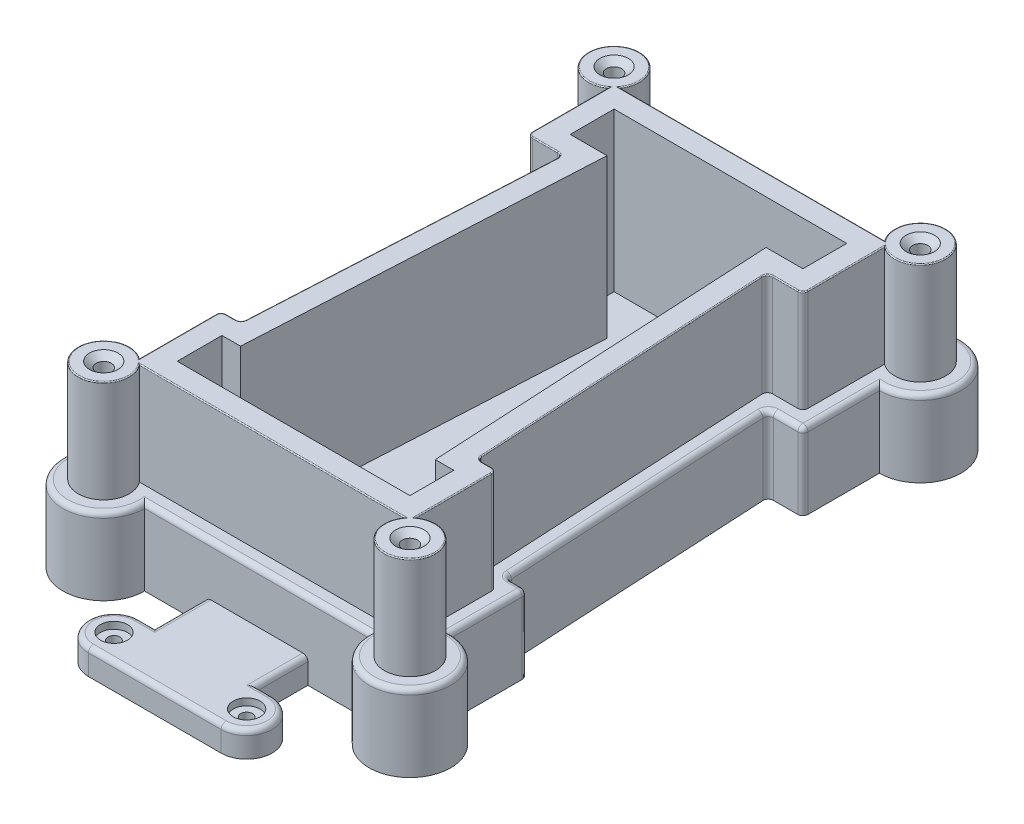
from build123d import *

# Parameters (mm, degrees)
EXTRUDE_A1_DEPTH           = 19.05
EXTRUDE_A2_DEPTH           = 6.35
EXTRUDE_A3_DEPTH           = 25.4
CUT_EXTRUDE_B1_DEPTH       = 39.37
HOLE_WIZARD_C1_D           = 3.7973
HOLE_WIZARD_C1_CSINK_D     = 7.0866
HOLE_WIZARD_C1_CSINK_ANGLE = 100
HOLE_WIZARD_C2_D           = 2.9464
HOLE_WIZARD_C2_CBORE_D     = 6.74624
HOLE_WIZARD_C2_CBORE_DEPTH = 1.7272
FILLET_D2_R                = 1.27
FILLET_D3_R                = 1.27
FILLET_D4_R                = 0.254


with BuildPart() as part:
    # Sketch1 → Extrude A1 (new body)
    with BuildSketch(Plane(origin=(0, 0, 0), x_dir=(1, 0, 0), z_dir=(0, 1, 0))):
        with BuildLine():
            Line((27.94, 63.5), (-27.94, 63.5))
            ThreePointArc((-27.94, 63.5), (-45.284204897, 70.684204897), (-38.1, 53.34))
            Line((-38.1, 53.34), (-38.1, 34.29))
            Line((-38.1, 34.29), (-29.425874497, 34.29))
            Line((-29.425874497, 34.29), (-33.02, -34.29))
            Line((-33.02, -34.29), (-38.1, -34.29))
            Line((-38.1, -34.29), (-38.1, -53.34))
            ThreePointArc((-38.1, -53.34), (-45.284204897, -70.684204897), (-27.94, -63.5))
            Line((-27.94, -63.5), (27.94, -63.5))
            ThreePointArc((27.94, -63.5), (45.284204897, -70.684204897), (38.1, -53.34))
            Line((38.1, -53.34), (38.1, -34.29))
            Line((38.1, -34.29), (33.02, -34.29))
            Line((33.02, -34.29), (29.425874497, 34.29))
            Line((29.425874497, 34.29), (38.1, 34.29))
            Line((38.1, 34.29), (38.1, 53.34))
            ThreePointArc((38.1, 53.34), (45.284204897, 70.684204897), (27.94, 63.5))
        make_face()
    extrude(amount=EXTRUDE_A1_DEPTH)

    # Sketch2 → Extrude A2 (add)
    with BuildSketch(Plane.XZ):
        with BuildLine():
            Line((-12.7, 63.5), (-12.7, 76.2))
            Line((-12.7, 76.2), (-16.51, 76.2))
            ThreePointArc((-16.51, 76.2), (-22.86, 82.55), (-16.51, 88.9))
            Line((-16.51, 88.9), (16.51, 88.9))
            ThreePointArc((16.51, 88.9), (22.86, 82.55), (16.51, 76.2))
            Line((16.51, 76.2), (12.7, 76.2))
            Line((12.7, 76.2), (12.7, 63.5))
            Line((12.7, 63.5), (-12.7, 63.5))
        make_face()
    extrude(amount=-EXTRUDE_A2_DEPTH)

    # Sketch3 → Extrude A3 (add)
    with BuildSketch(Plane(origin=(0, 19.05, 0), x_dir=(1, 0, 0), z_dir=(0, 1, 0))):
        with BuildLine():
            Line((-34.29, 38.1), (-25.410972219, 38.1))
            Line((-25.410972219, 38.1), (-29.404445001, -38.1))
            Line((-29.404445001, -38.1), (-34.29, -38.1))
            Line((-34.29, -38.1), (-34.29, -58.42))
            ThreePointArc((-34.29, -58.42), (-42.590128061, -67.990128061), (-33.02, -59.69))
            Line((-33.02, -59.69), (33.02, -59.69))
            ThreePointArc((33.02, -59.69), (42.590128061, -67.990128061), (34.29, -58.42))
            Line((34.29, -58.42), (34.29, -38.1))
            Line((34.29, -38.1), (29.404445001, -38.1))
            Line((29.404445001, -38.1), (25.410972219, 38.1))
            Line((25.410972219, 38.1), (34.29, 38.1))
            Line((34.29, 38.1), (34.29, 58.42))
            ThreePointArc((34.29, 58.42), (42.590128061, 67.990128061), (33.02, 59.69))
            Line((33.02, 59.69), (-33.02, 59.69))
            ThreePointArc((-33.02, 59.69), (-42.590128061, 67.990128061), (-34.29, 58.42))
            Line((-34.29, 58.42), (-34.29, 38.1))
        make_face()
    extrude(amount=EXTRUDE_A3_DEPTH)

    # Sketch9 → Cut-Extrude B1 (cut)
    with BuildSketch(Plane(origin=(0, 44.45, 0), x_dir=(1, 0, 0), z_dir=(0, 1, 0))):
        Polygon((-28.956, -43.223615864), (-28.956, -54.356), (28.956, -54.356), (28.956, -43.434), (24.342668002, -43.434), (20.154323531, 36.484373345), (19.790109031, 43.434), (26.749272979, 43.434), (28.956, 43.434), (28.956, 54.356), (-28.956, 54.356), (-28.956, 43.434), (-26.749272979, 43.434), (-19.790109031, 43.434), (-20.154323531, 36.484373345), (-24.014680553, -37.175626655), (-24.331642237, -43.223615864), align=None)
    extrude(amount=-CUT_EXTRUDE_B1_DEPTH, mode=Mode.SUBTRACT)

    # Hole Wizard C1 (through all)
    with Locations(Plane(origin=(0, 44.45, 0), x_dir=(-1, 0, 0), z_dir=(0, 1, 0))):
        with Locations((38.1, -63.5), (-38.1, -63.5), (-38.1, 63.5), (38.1, 63.5)):
            CounterSinkHole(HOLE_WIZARD_C1_D / 2, HOLE_WIZARD_C1_CSINK_D / 2, counter_sink_angle=HOLE_WIZARD_C1_CSINK_ANGLE)

    # Hole Wizard C2 (through all)
    with Locations(Plane(origin=(0, 6.35, 0), x_dir=(-1, 0, 0), z_dir=(0, 1, 0))):
        with Locations((16.51, 82.55), (-16.51, 82.55)):
            CounterBoreHole(HOLE_WIZARD_C2_D / 2, HOLE_WIZARD_C2_CBORE_D / 2, HOLE_WIZARD_C2_CBORE_DEPTH)

    # Fillet D2
    fillet_d2_edges = [part.edges().sort_by_distance(p)[0] for p in [
        (38.1, 9.525, -34.29),
        (29.425874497, 9.525, -34.29),
        (33.02, 9.525, 34.29),
        (38.1, 9.525, 34.29),
        (-38.1, 9.525, 34.29),
        (-33.02, 9.525, 34.29),
        (-29.425874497, 9.525, -34.29),
        (-38.1, 9.525, -34.29),
        (25.410972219, 31.75, -38.1),
        (34.29, 31.75, -38.1),
        (-34.29, 31.75, -38.1),
        (-25.410972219, 31.75, -38.1),
        (-29.404445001, 31.75, 38.1),
        (-34.29, 31.75, 38.1),
        (34.29, 31.75, 38.1),
        (29.404445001, 31.75, 38.1),
    ]]
    fillet(fillet_d2_edges, radius=FILLET_D2_R)

    # Fillet D3
    fillet_d3_edges = [part.edges().sort_by_distance(p)[0] for p in [
        (31.226420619, 19.05, 0.066466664),
        (35.5275925, 19.05, 34.29),
        (-33.797087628, 19.05, -34.29),
        (-31.226420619, 19.05, 0.066466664),
        (-35.5275925, 19.05, 34.29),
        (-38.1, 19.05, 44.45),
        (33.797087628, 19.05, -34.29),
        (38.1, 19.05, -44.45),
        (37.728025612, 19.05, -34.661974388),
        (37.728025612, 19.05, 34.661974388),
        (-37.728025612, 19.05, 34.661974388),
        (-37.728025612, 19.05, -34.661974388),
        (-45.284204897, 19.05, 70.684204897),
        (33.350974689, 19.05, 33.941225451),
        (29.842949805, 19.05, -33.894210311),
        (-29.842949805, 19.05, -33.894210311),
        (-33.350974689, 19.05, 33.941225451),
        (0, 19.05, 63.5),
        (45.284204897, 19.05, 70.684204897),
        (38.1, 19.05, 44.45),
        (-45.284204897, 19.05, -70.684204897),
        (45.284204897, 19.05, -70.684204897),
        (-12.7, 6.35, 69.85),
        (-14.605, 6.35, 76.2),
        (-22.86, 6.35, 82.55),
        (0, 6.35, 88.9),
        (22.86, 6.35, 82.55),
        (0, 19.05, -63.5),
        (14.605, 6.35, 76.2),
        (12.7, 6.35, 69.85),
        (-38.1, 19.05, -44.45),
    ]]
    fillet(fillet_d3_edges, radius=FILLET_D3_R)

    # Fillet D4
    fillet_d4_edges = [part.edges().sort_by_distance(p)[0] for p in [
        (27.41119198, 44.45, 0.066466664),
        (31.814815, 44.45, 38.1),
        (29.884636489, 44.45, -38.1),
        (-27.41119198, 44.45, 0.066466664),
        (-29.884636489, 44.45, -38.1),
        (34.29, 44.45, -48.895),
        (-31.814815, 44.45, 38.1),
        (-34.29, 44.45, 48.895),
        (33.918025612, 44.45, -38.471974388),
        (33.918025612, 44.45, 38.471974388),
        (-33.918025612, 44.45, 38.471974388),
        (-33.918025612, 44.45, -38.471974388),
        (29.735419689, 44.45, 37.751225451),
        (25.828047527, 44.45, -37.704210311),
        (-25.828047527, 44.45, -37.704210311),
        (-29.735419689, 44.45, 37.751225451),
        (42.590128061, 44.45, -67.990128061),
        (0, 44.45, -59.69),
        (-42.590128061, 44.45, -67.990128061),
        (-34.29, 44.45, -48.895),
        (-42.590128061, 44.45, 67.990128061),
        (0, 44.45, 59.69),
        (42.590128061, 44.45, 67.990128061),
        (34.29, 44.45, 48.895),
    ]]
    fillet(fillet_d4_edges, radius=FILLET_D4_R)


solid = part.part
